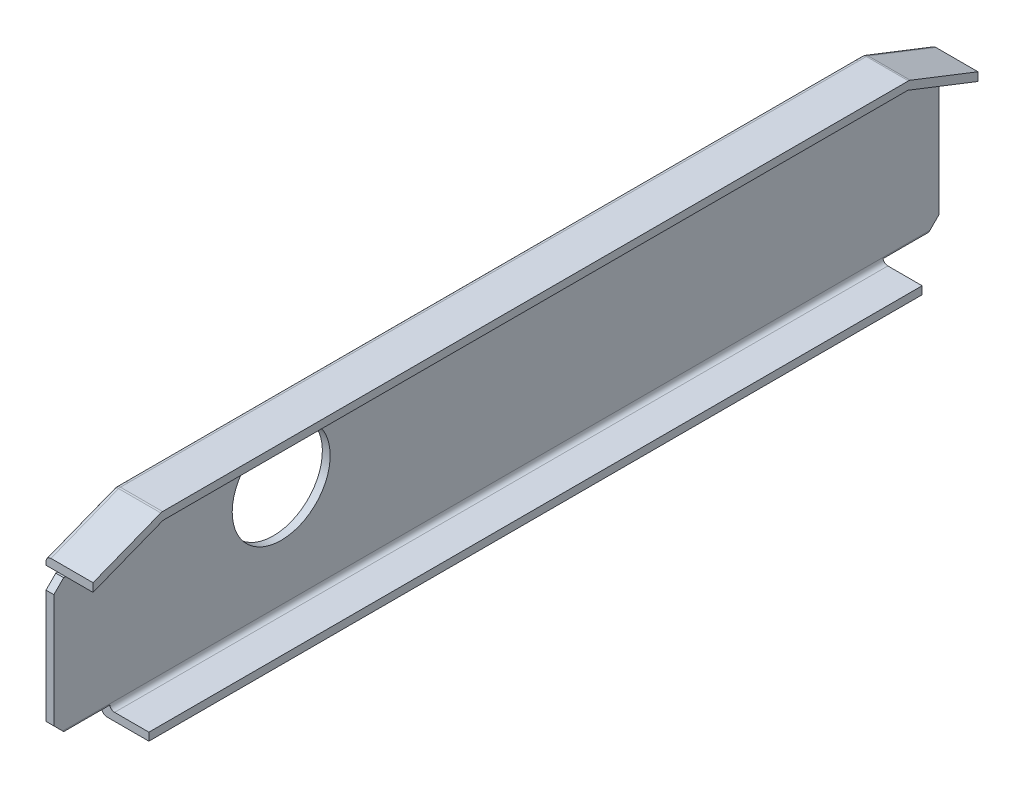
ISO-10303-21;
HEADER;
FILE_DESCRIPTION(('STEP AP214'),'2;1');
FILE_NAME('part.step','',(''),(''),'','','');
FILE_SCHEMA(('AUTOMOTIVE_DESIGN { 1 0 10303 214 1 1 1 1 }'));
ENDSEC;
DATA;
#1=APPLICATION_CONTEXT('core data for automotive mechanical design processes');
#2=APPLICATION_PROTOCOL_DEFINITION('international standard','automotive_design',2000,#1);
#3=PRODUCT_CONTEXT('',#1,'mechanical');
#4=PRODUCT('Part','Part','',(#3));
#5=PRODUCT_RELATED_PRODUCT_CATEGORY('part','',(#4));
#6=PRODUCT_DEFINITION_FORMATION('','',#4);
#7=PRODUCT_DEFINITION_CONTEXT('part definition',#1,'design');
#8=PRODUCT_DEFINITION('design','',#6,#7);
#9=PRODUCT_DEFINITION_SHAPE('','',#8);
#10=(LENGTH_UNIT() NAMED_UNIT(*) SI_UNIT(.MILLI.,.METRE.));
#11=(NAMED_UNIT(*) PLANE_ANGLE_UNIT() SI_UNIT($,.RADIAN.));
#12=(NAMED_UNIT(*) SI_UNIT($,.STERADIAN.) SOLID_ANGLE_UNIT());
#13=UNCERTAINTY_MEASURE_WITH_UNIT(LENGTH_MEASURE(1.E-05),#10,'distance_accuracy_value','');
#14=(GEOMETRIC_REPRESENTATION_CONTEXT(3) GLOBAL_UNCERTAINTY_ASSIGNED_CONTEXT((#13)) GLOBAL_UNIT_ASSIGNED_CONTEXT((#10,
#11,#12)) REPRESENTATION_CONTEXT('',''));
#15=CARTESIAN_POINT('',(0.,0.,0.));
#16=DIRECTION('',(0.,0.,1.));
#17=DIRECTION('',(1.,0.,0.));
#18=AXIS2_PLACEMENT_3D('',#15,#16,#17);
#19=CARTESIAN_POINT('',(0.,0.,903.));
#20=DIRECTION('',(1.,0.,0.));
#21=DIRECTION('',(0.,1.,0.));
#22=AXIS2_PLACEMENT_3D('',#19,#20,#21);
#23=PLANE('',#22);
#24=CARTESIAN_POINT('',(0.,-76.,671.));
#25=DIRECTION('',(-1.,0.,0.));
#26=DIRECTION('',(0.,-1.,0.));
#27=AXIS2_PLACEMENT_3D('',#24,#25,#26);
#28=CIRCLE('',#27,50.);
#29=CARTESIAN_POINT('',(0.,-126.,671.));
#30=VERTEX_POINT('',#29);
#31=EDGE_CURVE('E408',#30,#30,#28,.T.);
#32=ORIENTED_EDGE('',*,*,#31,.F.);
#33=EDGE_LOOP('',(#32));
#34=FACE_BOUND('',#33,.T.);
#35=DIRECTION('',(0.,0.,-1.));
#36=VECTOR('',#35,1.);
#37=CARTESIAN_POINT('',(0.,-5.,903.));
#38=LINE('',#37,#36);
#39=CARTESIAN_POINT('',(0.,-4.99999999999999,79.1722059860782));
#40=VERTEX_POINT('',#39);
#41=CARTESIAN_POINT('',(0.,-5.,70.9439872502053));
#42=VERTEX_POINT('',#41);
#43=EDGE_CURVE('E543',#40,#42,#38,.T.);
#44=ORIENTED_EDGE('',*,*,#43,.T.);
#45=DIRECTION('',(0.,-0.364598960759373,-0.931164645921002));
#46=VECTOR('',#45,1.);
#47=CARTESIAN_POINT('',(0.,-32.0644317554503,1.82299480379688));
#48=LINE('',#47,#46);
#49=CARTESIAN_POINT('',(0.,-32.778228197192,0.));
#50=VERTEX_POINT('',#49);
#51=EDGE_CURVE('E563',#42,#50,#48,.T.);
#52=ORIENTED_EDGE('',*,*,#51,.T.);
#53=DIRECTION('',(0.,-1.,0.));
#54=VECTOR('',#53,1.);
#55=CARTESIAN_POINT('',(0.,0.,0.));
#56=LINE('',#55,#54);
#57=CARTESIAN_POINT('',(0.,-36.,0.));
#58=VERTEX_POINT('',#57);
#59=EDGE_CURVE('E418',#50,#58,#56,.T.);
#60=ORIENTED_EDGE('',*,*,#59,.T.);
#61=DIRECTION('',(0.,0.,-1.));
#62=VECTOR('',#61,1.);
#63=CARTESIAN_POINT('',(0.,-36.,0.));
#64=LINE('',#63,#62);
#65=CARTESIAN_POINT('',(0.,-36.,57.));
#66=VERTEX_POINT('',#65);
#67=EDGE_CURVE('E378',#66,#58,#64,.T.);
#68=ORIENTED_EDGE('',*,*,#67,.F.);
#69=DIRECTION('',(0.,1.,0.));
#70=VECTOR('',#69,1.);
#71=CARTESIAN_POINT('',(0.,-36.,57.));
#72=LINE('',#71,#70);
#73=CARTESIAN_POINT('',(0.,-48.,57.));
#74=VERTEX_POINT('',#73);
#75=EDGE_CURVE('E375',#74,#66,#72,.T.);
#76=ORIENTED_EDGE('',*,*,#75,.F.);
#77=DIRECTION('',(0.,0.,1.));
#78=VECTOR('',#77,1.);
#79=CARTESIAN_POINT('',(0.,-48.,0.));
#80=LINE('',#79,#78);
#81=CARTESIAN_POINT('',(0.,-48.,10.0000000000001));
#82=VERTEX_POINT('',#81);
#83=EDGE_CURVE('E373',#82,#74,#80,.T.);
#84=ORIENTED_EDGE('',*,*,#83,.F.);
#85=DIRECTION('',(0.,0.707106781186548,0.707106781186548));
#86=VECTOR('',#85,1.);
#87=CARTESIAN_POINT('',(0.,-58.0000000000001,0.));
#88=LINE('',#87,#86);
#89=CARTESIAN_POINT('',(0.,-58.0000000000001,0.));
#90=VERTEX_POINT('',#89);
#91=EDGE_CURVE('E480',#82,#90,#88,.F.);
#92=ORIENTED_EDGE('',*,*,#91,.T.);
#93=CARTESIAN_POINT('',(0.,-174.,0.));
#94=VERTEX_POINT('',#93);
#95=EDGE_CURVE('E421',#90,#94,#56,.T.);
#96=ORIENTED_EDGE('',*,*,#95,.T.);
#97=DIRECTION('',(0.,0.707106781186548,-0.707106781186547));
#98=VECTOR('',#97,1.);
#99=CARTESIAN_POINT('',(0.,-174.,0.));
#100=LINE('',#99,#98);
#101=CARTESIAN_POINT('',(0.,-184.,10.0000000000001));
#102=VERTEX_POINT('',#101);
#103=EDGE_CURVE('E501',#94,#102,#100,.F.);
#104=ORIENTED_EDGE('',*,*,#103,.T.);
#105=DIRECTION('',(0.,0.,-1.));
#106=VECTOR('',#105,1.);
#107=CARTESIAN_POINT('',(0.,-184.,-33.0085939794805));
#108=LINE('',#107,#106);
#109=CARTESIAN_POINT('',(0.,-184.,57.));
#110=VERTEX_POINT('',#109);
#111=EDGE_CURVE('E340',#110,#102,#108,.T.);
#112=ORIENTED_EDGE('',*,*,#111,.F.);
#113=DIRECTION('',(0.,1.,0.));
#114=VECTOR('',#113,1.);
#115=CARTESIAN_POINT('',(0.,-184.,57.));
#116=LINE('',#115,#114);
#117=CARTESIAN_POINT('',(0.,-191.,57.));
#118=VERTEX_POINT('',#117);
#119=EDGE_CURVE('E334',#118,#110,#116,.T.);
#120=ORIENTED_EDGE('',*,*,#119,.F.);
#121=DIRECTION('',(0.,0.,-1.));
#122=VECTOR('',#121,1.);
#123=CARTESIAN_POINT('',(0.,-191.,903.));
#124=LINE('',#123,#122);
#125=CARTESIAN_POINT('',(0.,-191.,846.));
#126=VERTEX_POINT('',#125);
#127=EDGE_CURVE('E442',#118,#126,#124,.F.);
#128=ORIENTED_EDGE('',*,*,#127,.T.);
#129=DIRECTION('',(0.,-1.,0.));
#130=VECTOR('',#129,1.);
#131=CARTESIAN_POINT('',(0.,-184.,846.));
#132=LINE('',#131,#130);
#133=CARTESIAN_POINT('',(0.,-184.,846.));
#134=VERTEX_POINT('',#133);
#135=EDGE_CURVE('E359',#134,#126,#132,.T.);
#136=ORIENTED_EDGE('',*,*,#135,.F.);
#137=DIRECTION('',(0.,0.,-1.));
#138=VECTOR('',#137,1.);
#139=CARTESIAN_POINT('',(0.,-184.,1113.36549483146));
#140=LINE('',#139,#138);
#141=CARTESIAN_POINT('',(0.,-184.,893.));
#142=VERTEX_POINT('',#141);
#143=EDGE_CURVE('E354',#142,#134,#140,.T.);
#144=ORIENTED_EDGE('',*,*,#143,.F.);
#145=DIRECTION('',(0.,0.707106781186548,0.707106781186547));
#146=VECTOR('',#145,1.);
#147=CARTESIAN_POINT('',(0.,-184.,893.));
#148=LINE('',#147,#146);
#149=CARTESIAN_POINT('',(0.,-174.,903.));
#150=VERTEX_POINT('',#149);
#151=EDGE_CURVE('E503',#142,#150,#148,.T.);
#152=ORIENTED_EDGE('',*,*,#151,.T.);
#153=DIRECTION('',(0.,-1.,0.));
#154=VECTOR('',#153,1.);
#155=CARTESIAN_POINT('',(0.,0.,903.));
#156=LINE('',#155,#154);
#157=CARTESIAN_POINT('',(0.,-57.9999999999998,903.));
#158=VERTEX_POINT('',#157);
#159=EDGE_CURVE('E415',#158,#150,#156,.T.);
#160=ORIENTED_EDGE('',*,*,#159,.F.);
#161=DIRECTION('',(0.,0.707106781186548,-0.707106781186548));
#162=VECTOR('',#161,1.);
#163=CARTESIAN_POINT('',(0.,-48.,893.));
#164=LINE('',#163,#162);
#165=CARTESIAN_POINT('',(0.,-48.,893.));
#166=VERTEX_POINT('',#165);
#167=EDGE_CURVE('E478',#158,#166,#164,.T.);
#168=ORIENTED_EDGE('',*,*,#167,.T.);
#169=DIRECTION('',(0.,0.,1.));
#170=VECTOR('',#169,1.);
#171=CARTESIAN_POINT('',(0.,-48.,903.));
#172=LINE('',#171,#170);
#173=CARTESIAN_POINT('',(0.,-48.,846.));
#174=VERTEX_POINT('',#173);
#175=EDGE_CURVE('E396',#174,#166,#172,.T.);
#176=ORIENTED_EDGE('',*,*,#175,.F.);
#177=DIRECTION('',(0.,-1.,0.));
#178=VECTOR('',#177,1.);
#179=CARTESIAN_POINT('',(0.,-36.,846.));
#180=LINE('',#179,#178);
#181=CARTESIAN_POINT('',(0.,-36.,846.));
#182=VERTEX_POINT('',#181);
#183=EDGE_CURVE('E393',#182,#174,#180,.T.);
#184=ORIENTED_EDGE('',*,*,#183,.F.);
#185=DIRECTION('',(0.,0.,-1.));
#186=VECTOR('',#185,1.);
#187=CARTESIAN_POINT('',(0.,-36.,903.));
#188=LINE('',#187,#186);
#189=CARTESIAN_POINT('',(0.,-36.,903.));
#190=VERTEX_POINT('',#189);
#191=EDGE_CURVE('E390',#190,#182,#188,.T.);
#192=ORIENTED_EDGE('',*,*,#191,.F.);
#193=CARTESIAN_POINT('',(0.,-32.778228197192,903.));
#194=VERTEX_POINT('',#193);
#195=EDGE_CURVE('E412',#194,#190,#156,.T.);
#196=ORIENTED_EDGE('',*,*,#195,.F.);
#197=DIRECTION('',(0.,0.364598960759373,-0.931164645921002));
#198=VECTOR('',#197,1.);
#199=CARTESIAN_POINT('',(0.,-9.65582322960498,843.946715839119));
#200=LINE('',#199,#198);
#201=CARTESIAN_POINT('',(0.,-5.,832.056012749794));
#202=VERTEX_POINT('',#201);
#203=EDGE_CURVE('E528',#194,#202,#200,.T.);
#204=ORIENTED_EDGE('',*,*,#203,.T.);
#205=DIRECTION('',(0.,0.,-1.));
#206=VECTOR('',#205,1.);
#207=CARTESIAN_POINT('',(0.,-5.,903.));
#208=LINE('',#207,#206);
#209=CARTESIAN_POINT('',(0.,-4.99999999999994,823.827794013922));
#210=VERTEX_POINT('',#209);
#211=EDGE_CURVE('E520',#202,#210,#208,.T.);
#212=ORIENTED_EDGE('',*,*,#211,.T.);
#213=DIRECTION('',(0.,0.,-1.));
#214=VECTOR('',#213,1.);
#215=CARTESIAN_POINT('',(0.,-5.,903.));
#216=LINE('',#215,#214);
#217=EDGE_CURVE('E439',#210,#40,#216,.T.);
#218=ORIENTED_EDGE('',*,*,#217,.T.);
#219=EDGE_LOOP('',(#44,#52,#60,#68,#76,#84,#92,#96,#104,#112,#120,#128,#136,#144,#152,#160,#168,
#176,#184,#192,#196,#204,#212,#218));
#220=FACE_BOUND('',#219,.T.);
#221=ADVANCED_FACE('F41',(#34,#220),#23,.F.);
#222=CARTESIAN_POINT('',(8.00000000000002,-8.,903.));
#223=DIRECTION('',(0.,1.,0.));
#224=DIRECTION('',(-1.,0.,0.));
#225=AXIS2_PLACEMENT_3D('',#222,#223,#224);
#226=PLANE('',#225);
#227=DIRECTION('',(0.,0.,-1.));
#228=VECTOR('',#227,1.);
#229=CARTESIAN_POINT('',(13.,-8.,0.));
#230=LINE('',#229,#228);
#231=CARTESIAN_POINT('',(13.,-8.,830.545633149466));
#232=VERTEX_POINT('',#231);
#233=CARTESIAN_POINT('',(13.,-8.,72.4543668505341));
#234=VERTEX_POINT('',#233);
#235=EDGE_CURVE('E451',#232,#234,#230,.T.);
#236=ORIENTED_EDGE('',*,*,#235,.T.);
#237=DIRECTION('',(1.,0.,0.));
#238=VECTOR('',#237,1.);
#239=CARTESIAN_POINT('',(8.00000000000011,-8.,72.4543668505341));
#240=LINE('',#239,#238);
#241=CARTESIAN_POINT('',(48.,-8.,72.4543668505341));
#242=VERTEX_POINT('',#241);
#243=EDGE_CURVE('E583',#234,#242,#240,.T.);
#244=ORIENTED_EDGE('',*,*,#243,.T.);
#245=DIRECTION('',(0.,0.,-1.));
#246=VECTOR('',#245,1.);
#247=CARTESIAN_POINT('',(48.,-8.,903.));
#248=LINE('',#247,#246);
#249=CARTESIAN_POINT('',(48.,-8.,830.545633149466));
#250=VERTEX_POINT('',#249);
#251=EDGE_CURVE('E431',#250,#242,#248,.T.);
#252=ORIENTED_EDGE('',*,*,#251,.F.);
#253=DIRECTION('',(-1.,0.,0.));
#254=VECTOR('',#253,1.);
#255=CARTESIAN_POINT('',(8.00000000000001,-8.,830.545633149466));
#256=LINE('',#255,#254);
#257=EDGE_CURVE('E553',#250,#232,#256,.T.);
#258=ORIENTED_EDGE('',*,*,#257,.T.);
#259=EDGE_LOOP('',(#236,#244,#252,#258));
#260=FACE_BOUND('',#259,.T.);
#261=ADVANCED_FACE('F688',(#260),#226,.F.);
#262=CARTESIAN_POINT('',(8.00000000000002,-188.,903.));
#263=DIRECTION('',(-1.,0.,0.));
#264=DIRECTION('',(0.,0.,1.));
#265=AXIS2_PLACEMENT_3D('',#262,#263,#264);
#266=PLANE('',#265);
#267=CARTESIAN_POINT('',(8.00000000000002,-76.,671.));
#268=DIRECTION('',(-1.,0.,0.));
#269=DIRECTION('',(0.,0.,1.));
#270=AXIS2_PLACEMENT_3D('',#267,#268,#269);
#271=CIRCLE('',#270,50.);
#272=CARTESIAN_POINT('',(8.00000000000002,-76.,721.));
#273=VERTEX_POINT('',#272);
#274=EDGE_CURVE('E411',#273,#273,#271,.T.);
#275=ORIENTED_EDGE('',*,*,#274,.T.);
#276=EDGE_LOOP('',(#275));
#277=FACE_BOUND('',#276,.T.);
#278=DIRECTION('',(0.,0.,-1.));
#279=VECTOR('',#278,1.);
#280=CARTESIAN_POINT('',(8.00000000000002,-36.,903.));
#281=LINE('',#280,#279);
#282=CARTESIAN_POINT('',(8.00000000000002,-36.,57.));
#283=VERTEX_POINT('',#282);
#284=CARTESIAN_POINT('',(8.00000000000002,-36.,13.7136978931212));
#285=VERTEX_POINT('',#284);
#286=EDGE_CURVE('E388',#283,#285,#281,.T.);
#287=ORIENTED_EDGE('',*,*,#286,.T.);
#288=DIRECTION('',(0.,0.364598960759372,0.931164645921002));
#289=VECTOR('',#288,1.);
#290=CARTESIAN_POINT('',(8.00000000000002,245.708452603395,733.180782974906));
#291=LINE('',#290,#289);
#292=CARTESIAN_POINT('',(8.00000000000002,-13.,72.4543668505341));
#293=VERTEX_POINT('',#292);
#294=EDGE_CURVE('E600',#285,#293,#291,.T.);
#295=ORIENTED_EDGE('',*,*,#294,.T.);
#296=DIRECTION('',(0.,0.,-1.));
#297=VECTOR('',#296,1.);
#298=CARTESIAN_POINT('',(8.00000000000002,-13.,903.));
#299=LINE('',#298,#297);
#300=CARTESIAN_POINT('',(8.00000000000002,-13.,830.545633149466));
#301=VERTEX_POINT('',#300);
#302=EDGE_CURVE('E444',#293,#301,#299,.F.);
#303=ORIENTED_EDGE('',*,*,#302,.T.);
#304=DIRECTION('',(0.,-0.364598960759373,0.931164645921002));
#305=VECTOR('',#304,1.);
#306=CARTESIAN_POINT('',(8.00000000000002,-60.8615483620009,952.781257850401));
#307=LINE('',#306,#305);
#308=CARTESIAN_POINT('',(8.00000000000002,-36.,889.286302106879));
#309=VERTEX_POINT('',#308);
#310=EDGE_CURVE('E572',#301,#309,#307,.T.);
#311=ORIENTED_EDGE('',*,*,#310,.T.);
#312=DIRECTION('',(0.,0.,-1.));
#313=VECTOR('',#312,1.);
#314=CARTESIAN_POINT('',(8.00000000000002,-36.,903.));
#315=LINE('',#314,#313);
#316=CARTESIAN_POINT('',(8.00000000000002,-36.,846.));
#317=VERTEX_POINT('',#316);
#318=EDGE_CURVE('E402',#309,#317,#315,.T.);
#319=ORIENTED_EDGE('',*,*,#318,.T.);
#320=DIRECTION('',(0.,-1.,0.));
#321=VECTOR('',#320,1.);
#322=CARTESIAN_POINT('',(8.00000000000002,-188.,846.));
#323=LINE('',#322,#321);
#324=CARTESIAN_POINT('',(8.00000000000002,-48.,846.));
#325=VERTEX_POINT('',#324);
#326=EDGE_CURVE('E459',#317,#325,#323,.T.);
#327=ORIENTED_EDGE('',*,*,#326,.T.);
#328=DIRECTION('',(0.,0.,1.));
#329=VECTOR('',#328,1.);
#330=CARTESIAN_POINT('',(8.00000000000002,-48.,903.));
#331=LINE('',#330,#329);
#332=CARTESIAN_POINT('',(8.00000000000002,-48.,893.));
#333=VERTEX_POINT('',#332);
#334=EDGE_CURVE('E405',#325,#333,#331,.T.);
#335=ORIENTED_EDGE('',*,*,#334,.T.);
#336=DIRECTION('',(0.,-0.707106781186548,0.707106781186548));
#337=VECTOR('',#336,1.);
#338=CARTESIAN_POINT('',(8.00000000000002,-48.,893.));
#339=LINE('',#338,#337);
#340=CARTESIAN_POINT('',(8.00000000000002,-57.9999999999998,903.));
#341=VERTEX_POINT('',#340);
#342=EDGE_CURVE('E471',#333,#341,#339,.T.);
#343=ORIENTED_EDGE('',*,*,#342,.T.);
#344=DIRECTION('',(0.,1.,0.));
#345=VECTOR('',#344,1.);
#346=CARTESIAN_POINT('',(8.00000000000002,-188.,903.));
#347=LINE('',#346,#345);
#348=CARTESIAN_POINT('',(8.00000000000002,-174.,903.));
#349=VERTEX_POINT('',#348);
#350=EDGE_CURVE('E414',#349,#341,#347,.T.);
#351=ORIENTED_EDGE('',*,*,#350,.F.);
#352=DIRECTION('',(0.,-0.707106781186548,-0.707106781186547));
#353=VECTOR('',#352,1.);
#354=CARTESIAN_POINT('',(8.00000000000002,-184.,893.));
#355=LINE('',#354,#353);
#356=CARTESIAN_POINT('',(8.00000000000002,-183.,894.));
#357=VERTEX_POINT('',#356);
#358=EDGE_CURVE('E509',#349,#357,#355,.T.);
#359=ORIENTED_EDGE('',*,*,#358,.T.);
#360=DIRECTION('',(0.,0.,-1.));
#361=VECTOR('',#360,1.);
#362=CARTESIAN_POINT('',(8.00000000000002,-183.,0.));
#363=LINE('',#362,#361);
#364=CARTESIAN_POINT('',(8.00000000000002,-183.,9.00000000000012));
#365=VERTEX_POINT('',#364);
#366=EDGE_CURVE('E446',#357,#365,#363,.T.);
#367=ORIENTED_EDGE('',*,*,#366,.T.);
#368=DIRECTION('',(0.,-0.707106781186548,0.707106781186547));
#369=VECTOR('',#368,1.);
#370=CARTESIAN_POINT('',(8.00000000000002,-174.,0.));
#371=LINE('',#370,#369);
#372=CARTESIAN_POINT('',(8.00000000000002,-174.,0.));
#373=VERTEX_POINT('',#372);
#374=EDGE_CURVE('E507',#365,#373,#371,.F.);
#375=ORIENTED_EDGE('',*,*,#374,.T.);
#376=DIRECTION('',(0.,1.,0.));
#377=VECTOR('',#376,1.);
#378=CARTESIAN_POINT('',(8.00000000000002,-188.,0.));
#379=LINE('',#378,#377);
#380=CARTESIAN_POINT('',(8.00000000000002,-58.0000000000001,0.));
#381=VERTEX_POINT('',#380);
#382=EDGE_CURVE('E420',#373,#381,#379,.T.);
#383=ORIENTED_EDGE('',*,*,#382,.T.);
#384=DIRECTION('',(0.,-0.707106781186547,-0.707106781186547));
#385=VECTOR('',#384,1.);
#386=CARTESIAN_POINT('',(8.00000000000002,-58.0000000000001,0.));
#387=LINE('',#386,#385);
#388=CARTESIAN_POINT('',(8.00000000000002,-48.,10.0000000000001));
#389=VERTEX_POINT('',#388);
#390=EDGE_CURVE('E474',#381,#389,#387,.F.);
#391=ORIENTED_EDGE('',*,*,#390,.T.);
#392=DIRECTION('',(0.,0.,1.));
#393=VECTOR('',#392,1.);
#394=CARTESIAN_POINT('',(8.00000000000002,-48.,903.));
#395=LINE('',#394,#393);
#396=CARTESIAN_POINT('',(8.00000000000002,-48.,57.));
#397=VERTEX_POINT('',#396);
#398=EDGE_CURVE('E384',#389,#397,#395,.T.);
#399=ORIENTED_EDGE('',*,*,#398,.T.);
#400=DIRECTION('',(0.,1.,0.));
#401=VECTOR('',#400,1.);
#402=CARTESIAN_POINT('',(8.00000000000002,-188.,57.));
#403=LINE('',#402,#401);
#404=EDGE_CURVE('E465',#397,#283,#403,.T.);
#405=ORIENTED_EDGE('',*,*,#404,.T.);
#406=EDGE_LOOP('',(#287,#295,#303,#311,#319,#327,#335,#343,#351,#359,#367,#375,#383,#391,#399,#405));
#407=FACE_BOUND('',#406,.T.);
#408=ADVANCED_FACE('F694',(#277,#407),#266,.F.);
#409=CARTESIAN_POINT('',(13.,-13.,903.));
#410=DIRECTION('',(0.,0.,1.));
#411=DIRECTION('',(1.,0.,0.));
#412=AXIS2_PLACEMENT_3D('',#409,#410,#411);
#413=CYLINDRICAL_SURFACE('',#412,5.);
#414=ORIENTED_EDGE('',*,*,#302,.F.);
#415=CARTESIAN_POINT('',(13.,-13.,72.4543668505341));
#416=DIRECTION('',(0.,0.,1.));
#417=DIRECTION('',(1.,0.,0.));
#418=AXIS2_PLACEMENT_3D('',#415,#416,#417);
#419=CIRCLE('',#418,5.);
#420=EDGE_CURVE('E598',#293,#234,#419,.F.);
#421=ORIENTED_EDGE('',*,*,#420,.T.);
#422=ORIENTED_EDGE('',*,*,#235,.F.);
#423=CARTESIAN_POINT('',(13.,-13.,830.545633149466));
#424=DIRECTION('',(0.,0.,1.));
#425=DIRECTION('',(1.,0.,0.));
#426=AXIS2_PLACEMENT_3D('',#423,#424,#425);
#427=CIRCLE('',#426,5.);
#428=EDGE_CURVE('E560',#232,#301,#427,.T.);
#429=ORIENTED_EDGE('',*,*,#428,.T.);
#430=EDGE_LOOP('',(#414,#421,#422,#429));
#431=FACE_BOUND('',#430,.T.);
#432=ADVANCED_FACE('F691',(#431),#413,.F.);
#433=CARTESIAN_POINT('',(5.,-5.,903.));
#434=DIRECTION('',(0.,0.,-1.));
#435=DIRECTION('',(-1.,0.,0.));
#436=AXIS2_PLACEMENT_3D('',#433,#434,#435);
#437=CYLINDRICAL_SURFACE('',#436,5.);
#438=DIRECTION('',(0.,0.,-1.));
#439=VECTOR('',#438,1.);
#440=CARTESIAN_POINT('',(5.,0.,903.));
#441=LINE('',#440,#439);
#442=CARTESIAN_POINT('',(5.,0.,79.1722059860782));
#443=VERTEX_POINT('',#442);
#444=CARTESIAN_POINT('',(5.,0.,823.827794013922));
#445=VERTEX_POINT('',#444);
#446=EDGE_CURVE('E454',#443,#445,#441,.F.);
#447=ORIENTED_EDGE('',*,*,#446,.F.);
#448=CARTESIAN_POINT('',(5.,-4.99999999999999,79.1722059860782));
#449=DIRECTION('',(0.,0.,-1.));
#450=DIRECTION('',(-1.,0.,0.));
#451=AXIS2_PLACEMENT_3D('',#448,#449,#450);
#452=CIRCLE('',#451,5.);
#453=EDGE_CURVE('E551',#443,#40,#452,.F.);
#454=ORIENTED_EDGE('',*,*,#453,.T.);
#455=ORIENTED_EDGE('',*,*,#217,.F.);
#456=CARTESIAN_POINT('',(5.,-5.,823.827794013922));
#457=DIRECTION('',(0.,0.,-1.));
#458=DIRECTION('',(-1.,0.,0.));
#459=AXIS2_PLACEMENT_3D('',#456,#457,#458);
#460=CIRCLE('',#459,5.);
#461=EDGE_CURVE('E525',#210,#445,#460,.T.);
#462=ORIENTED_EDGE('',*,*,#461,.T.);
#463=EDGE_LOOP('',(#447,#454,#455,#462));
#464=FACE_BOUND('',#463,.T.);
#465=ADVANCED_FACE('F644',(#464),#437,.T.);
#466=CARTESIAN_POINT('',(8.00000000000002,-8.00000000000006,0.));
#467=DIRECTION('',(0.,0.,1.));
#468=DIRECTION('',(1.,0.,0.));
#469=AXIS2_PLACEMENT_3D('',#466,#467,#468);
#470=PLANE('',#469);
#471=ORIENTED_EDGE('',*,*,#59,.F.);
#472=CARTESIAN_POINT('',(5.,-32.778228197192,0.));
#473=DIRECTION('',(0.,0.,1.));
#474=DIRECTION('',(0.,1.,0.));
#475=AXIS2_PLACEMENT_3D('',#472,#473,#474);
#476=ELLIPSE('',#475,5.3696196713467,5.);
#477=CARTESIAN_POINT('',(5.,-27.4086085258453,0.));
#478=VERTEX_POINT('',#477);
#479=EDGE_CURVE('E295',#50,#478,#476,.F.);
#480=ORIENTED_EDGE('',*,*,#479,.T.);
#481=DIRECTION('',(1.,0.,0.));
#482=VECTOR('',#481,1.);
#483=CARTESIAN_POINT('',(-98.738624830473,-27.4086085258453,0.));
#484=LINE('',#483,#482);
#485=CARTESIAN_POINT('',(48.,-27.4086085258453,0.));
#486=VERTEX_POINT('',#485);
#487=EDGE_CURVE('E288',#478,#486,#484,.T.);
#488=ORIENTED_EDGE('',*,*,#487,.T.);
#489=DIRECTION('',(0.,1.,0.));
#490=VECTOR('',#489,1.);
#491=CARTESIAN_POINT('',(48.,-27.4086085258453,0.));
#492=LINE('',#491,#490);
#493=CARTESIAN_POINT('',(48.,-36.,0.));
#494=VERTEX_POINT('',#493);
#495=EDGE_CURVE('E294',#494,#486,#492,.T.);
#496=ORIENTED_EDGE('',*,*,#495,.F.);
#497=DIRECTION('',(1.,0.,0.));
#498=VECTOR('',#497,1.);
#499=CARTESIAN_POINT('',(-98.738624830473,-36.,0.));
#500=LINE('',#499,#498);
#501=CARTESIAN_POINT('',(13.,-36.,0.));
#502=VERTEX_POINT('',#501);
#503=EDGE_CURVE('E298',#502,#494,#500,.T.);
#504=ORIENTED_EDGE('',*,*,#503,.F.);
#505=DIRECTION('',(-1.,0.,0.));
#506=VECTOR('',#505,1.);
#507=CARTESIAN_POINT('',(8.00000000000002,-36.,0.));
#508=LINE('',#507,#506);
#509=EDGE_CURVE('E462',#502,#58,#508,.T.);
#510=ORIENTED_EDGE('',*,*,#509,.T.);
#511=EDGE_LOOP('',(#471,#480,#488,#496,#504,#510));
#512=FACE_BOUND('',#511,.T.);
#513=ADVANCED_FACE('F291',(#512),#470,.F.);
#514=CARTESIAN_POINT('',(8.00000000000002,-8.00000000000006,903.));
#515=DIRECTION('',(0.,0.,1.));
#516=DIRECTION('',(1.,0.,0.));
#517=AXIS2_PLACEMENT_3D('',#514,#515,#516);
#518=PLANE('',#517);
#519=ORIENTED_EDGE('',*,*,#159,.T.);
#520=DIRECTION('',(1.,0.,0.));
#521=VECTOR('',#520,1.);
#522=CARTESIAN_POINT('',(8.10102051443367,-174.,903.));
#523=LINE('',#522,#521);
#524=EDGE_CURVE('E505',#150,#349,#523,.T.);
#525=ORIENTED_EDGE('',*,*,#524,.T.);
#526=ORIENTED_EDGE('',*,*,#350,.T.);
#527=DIRECTION('',(-1.,0.,0.));
#528=VECTOR('',#527,1.);
#529=CARTESIAN_POINT('',(0.,-57.9999999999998,903.));
#530=LINE('',#529,#528);
#531=EDGE_CURVE('E485',#341,#158,#530,.T.);
#532=ORIENTED_EDGE('',*,*,#531,.T.);
#533=EDGE_LOOP('',(#519,#525,#526,#532));
#534=FACE_BOUND('',#533,.T.);
#535=ADVANCED_FACE('F766',(#534),#518,.T.);
#536=CARTESIAN_POINT('',(48.,-8.,903.));
#537=DIRECTION('',(-1.,0.,0.));
#538=DIRECTION('',(0.,0.,1.));
#539=AXIS2_PLACEMENT_3D('',#536,#537,#538);
#540=PLANE('',#539);
#541=DIRECTION('',(0.,0.364598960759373,0.931164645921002));
#542=VECTOR('',#541,1.);
#543=CARTESIAN_POINT('',(48.,0.,70.));
#544=LINE('',#543,#542);
#545=CARTESIAN_POINT('',(48.,-0.344176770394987,69.1209924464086));
#546=VERTEX_POINT('',#545);
#547=EDGE_CURVE('E302',#486,#546,#544,.T.);
#548=ORIENTED_EDGE('',*,*,#547,.T.);
#549=CARTESIAN_POINT('',(48.,-5.,70.9439872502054));
#550=DIRECTION('',(-1.,0.,0.));
#551=DIRECTION('',(0.,0.,1.));
#552=AXIS2_PLACEMENT_3D('',#549,#550,#551);
#553=CIRCLE('',#552,5.);
#554=CARTESIAN_POINT('',(48.,0.,70.9439872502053));
#555=VERTEX_POINT('',#554);
#556=EDGE_CURVE('E574',#546,#555,#553,.F.);
#557=ORIENTED_EDGE('',*,*,#556,.T.);
#558=DIRECTION('',(0.,0.,-1.));
#559=VECTOR('',#558,1.);
#560=CARTESIAN_POINT('',(48.,0.,903.));
#561=LINE('',#560,#559);
#562=CARTESIAN_POINT('',(48.,0.,832.056012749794));
#563=VERTEX_POINT('',#562);
#564=EDGE_CURVE('E428',#563,#555,#561,.T.);
#565=ORIENTED_EDGE('',*,*,#564,.F.);
#566=CARTESIAN_POINT('',(48.,-5.,832.056012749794));
#567=DIRECTION('',(-1.,0.,0.));
#568=DIRECTION('',(0.,0.,1.));
#569=AXIS2_PLACEMENT_3D('',#566,#567,#568);
#570=CIRCLE('',#569,5.);
#571=CARTESIAN_POINT('',(48.,-0.344176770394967,833.879007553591));
#572=VERTEX_POINT('',#571);
#573=EDGE_CURVE('E541',#563,#572,#570,.F.);
#574=ORIENTED_EDGE('',*,*,#573,.T.);
#575=DIRECTION('',(0.,-0.364598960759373,0.931164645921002));
#576=VECTOR('',#575,1.);
#577=CARTESIAN_POINT('',(48.,0.,833.));
#578=LINE('',#577,#576);
#579=CARTESIAN_POINT('',(48.,-27.4086085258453,903.));
#580=VERTEX_POINT('',#579);
#581=EDGE_CURVE('E328',#572,#580,#578,.T.);
#582=ORIENTED_EDGE('',*,*,#581,.T.);
#583=DIRECTION('',(0.,-1.,0.));
#584=VECTOR('',#583,1.);
#585=CARTESIAN_POINT('',(48.,-27.4086085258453,903.));
#586=LINE('',#585,#584);
#587=CARTESIAN_POINT('',(48.,-36.0000000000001,903.));
#588=VERTEX_POINT('',#587);
#589=EDGE_CURVE('E321',#580,#588,#586,.T.);
#590=ORIENTED_EDGE('',*,*,#589,.T.);
#591=DIRECTION('',(0.,0.364598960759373,-0.931164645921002));
#592=VECTOR('',#591,1.);
#593=CARTESIAN_POINT('',(48.,-36.0000000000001,903.));
#594=LINE('',#593,#592);
#595=CARTESIAN_POINT('',(48.,-8.34417677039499,832.368627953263));
#596=VERTEX_POINT('',#595);
#597=EDGE_CURVE('E324',#588,#596,#594,.T.);
#598=ORIENTED_EDGE('',*,*,#597,.T.);
#599=CARTESIAN_POINT('',(48.,-13.,830.545633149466));
#600=DIRECTION('',(-1.,0.,0.));
#601=DIRECTION('',(0.,0.,1.));
#602=AXIS2_PLACEMENT_3D('',#599,#600,#601);
#603=CIRCLE('',#602,5.);
#604=EDGE_CURVE('E578',#596,#250,#603,.T.);
#605=ORIENTED_EDGE('',*,*,#604,.T.);
#606=ORIENTED_EDGE('',*,*,#251,.T.);
#607=CARTESIAN_POINT('',(48.,-13.,72.4543668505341));
#608=DIRECTION('',(-1.,0.,0.));
#609=DIRECTION('',(0.,0.,1.));
#610=AXIS2_PLACEMENT_3D('',#607,#608,#609);
#611=CIRCLE('',#610,5.);
#612=CARTESIAN_POINT('',(48.,-8.34417677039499,70.6313720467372));
#613=VERTEX_POINT('',#612);
#614=EDGE_CURVE('E51',#242,#613,#611,.T.);
#615=ORIENTED_EDGE('',*,*,#614,.T.);
#616=DIRECTION('',(0.,-0.364598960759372,-0.931164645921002));
#617=VECTOR('',#616,1.);
#618=CARTESIAN_POINT('',(48.,-36.,0.));
#619=LINE('',#618,#617);
#620=EDGE_CURVE('E299',#613,#494,#619,.T.);
#621=ORIENTED_EDGE('',*,*,#620,.T.);
#622=ORIENTED_EDGE('',*,*,#495,.T.);
#623=EDGE_LOOP('',(#548,#557,#565,#574,#582,#590,#598,#605,#606,#615,#621,#622));
#624=FACE_BOUND('',#623,.T.);
#625=ADVANCED_FACE('F309',(#624),#540,.F.);
#626=CARTESIAN_POINT('',(48.,0.,903.));
#627=DIRECTION('',(0.,-1.,0.));
#628=DIRECTION('',(1.,0.,0.));
#629=AXIS2_PLACEMENT_3D('',#626,#627,#628);
#630=PLANE('',#629);
#631=ORIENTED_EDGE('',*,*,#564,.T.);
#632=DIRECTION('',(1.,0.,0.));
#633=VECTOR('',#632,1.);
#634=CARTESIAN_POINT('',(5.,0.,70.9439872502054));
#635=LINE('',#634,#633);
#636=CARTESIAN_POINT('',(5.,0.,70.9439872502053));
#637=VERTEX_POINT('',#636);
#638=EDGE_CURVE('E576',#555,#637,#635,.F.);
#639=ORIENTED_EDGE('',*,*,#638,.T.);
#640=DIRECTION('',(0.,0.,-1.));
#641=VECTOR('',#640,1.);
#642=CARTESIAN_POINT('',(5.,0.,903.));
#643=LINE('',#642,#641);
#644=EDGE_CURVE('E549',#637,#443,#643,.F.);
#645=ORIENTED_EDGE('',*,*,#644,.T.);
#646=ORIENTED_EDGE('',*,*,#446,.T.);
#647=DIRECTION('',(0.,0.,-1.));
#648=VECTOR('',#647,1.);
#649=CARTESIAN_POINT('',(5.,0.,903.));
#650=LINE('',#649,#648);
#651=CARTESIAN_POINT('',(5.,0.,832.056012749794));
#652=VERTEX_POINT('',#651);
#653=EDGE_CURVE('E522',#445,#652,#650,.F.);
#654=ORIENTED_EDGE('',*,*,#653,.T.);
#655=DIRECTION('',(1.,0.,0.));
#656=VECTOR('',#655,1.);
#657=CARTESIAN_POINT('',(48.,0.,832.056012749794));
#658=LINE('',#657,#656);
#659=EDGE_CURVE('E539',#652,#563,#658,.T.);
#660=ORIENTED_EDGE('',*,*,#659,.T.);
#661=EDGE_LOOP('',(#631,#639,#645,#646,#654,#660));
#662=FACE_BOUND('',#661,.T.);
#663=ADVANCED_FACE('F642',(#662),#630,.F.);
#664=CARTESIAN_POINT('',(0.,-196.,903.));
#665=DIRECTION('',(0.,1.,0.));
#666=DIRECTION('',(0.,0.,1.));
#667=AXIS2_PLACEMENT_3D('',#664,#665,#666);
#668=PLANE('',#667);
#669=DIRECTION('',(0.,0.,-1.));
#670=VECTOR('',#669,1.);
#671=CARTESIAN_POINT('',(5.00000000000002,-196.,903.));
#672=LINE('',#671,#670);
#673=CARTESIAN_POINT('',(5.00000000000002,-196.,846.));
#674=VERTEX_POINT('',#673);
#675=CARTESIAN_POINT('',(5.00000000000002,-196.,57.));
#676=VERTEX_POINT('',#675);
#677=EDGE_CURVE('E434',#674,#676,#672,.T.);
#678=ORIENTED_EDGE('',*,*,#677,.T.);
#679=DIRECTION('',(1.,0.,0.));
#680=VECTOR('',#679,1.);
#681=CARTESIAN_POINT('',(0.,-196.,57.));
#682=LINE('',#681,#680);
#683=CARTESIAN_POINT('',(48.,-196.,57.));
#684=VERTEX_POINT('',#683);
#685=EDGE_CURVE('E351',#676,#684,#682,.T.);
#686=ORIENTED_EDGE('',*,*,#685,.T.);
#687=DIRECTION('',(0.,0.,-1.));
#688=VECTOR('',#687,1.);
#689=CARTESIAN_POINT('',(48.,-196.,903.));
#690=LINE('',#689,#688);
#691=CARTESIAN_POINT('',(48.,-196.,846.));
#692=VERTEX_POINT('',#691);
#693=EDGE_CURVE('E425',#692,#684,#690,.T.);
#694=ORIENTED_EDGE('',*,*,#693,.F.);
#695=DIRECTION('',(-1.,0.,0.));
#696=VECTOR('',#695,1.);
#697=CARTESIAN_POINT('',(0.,-196.,846.));
#698=LINE('',#697,#696);
#699=EDGE_CURVE('E370',#692,#674,#698,.T.);
#700=ORIENTED_EDGE('',*,*,#699,.T.);
#701=EDGE_LOOP('',(#678,#686,#694,#700));
#702=FACE_BOUND('',#701,.T.);
#703=ADVANCED_FACE('F755',(#702),#668,.F.);
#704=CARTESIAN_POINT('',(48.,-196.,903.));
#705=DIRECTION('',(-1.,0.,0.));
#706=DIRECTION('',(0.,0.,1.));
#707=AXIS2_PLACEMENT_3D('',#704,#705,#706);
#708=PLANE('',#707);
#709=ORIENTED_EDGE('',*,*,#693,.T.);
#710=DIRECTION('',(0.,1.,0.));
#711=VECTOR('',#710,1.);
#712=CARTESIAN_POINT('',(48.,-184.,57.));
#713=LINE('',#712,#711);
#714=CARTESIAN_POINT('',(48.,-188.,57.));
#715=VERTEX_POINT('',#714);
#716=EDGE_CURVE('E336',#684,#715,#713,.T.);
#717=ORIENTED_EDGE('',*,*,#716,.T.);
#718=DIRECTION('',(0.,0.,-1.));
#719=VECTOR('',#718,1.);
#720=CARTESIAN_POINT('',(48.,-188.,903.));
#721=LINE('',#720,#719);
#722=CARTESIAN_POINT('',(48.,-188.,846.));
#723=VERTEX_POINT('',#722);
#724=EDGE_CURVE('E417',#723,#715,#721,.T.);
#725=ORIENTED_EDGE('',*,*,#724,.F.);
#726=DIRECTION('',(0.,-1.,0.));
#727=VECTOR('',#726,1.);
#728=CARTESIAN_POINT('',(48.,-184.,846.));
#729=LINE('',#728,#727);
#730=EDGE_CURVE('E355',#723,#692,#729,.T.);
#731=ORIENTED_EDGE('',*,*,#730,.T.);
#732=EDGE_LOOP('',(#709,#717,#725,#731));
#733=FACE_BOUND('',#732,.T.);
#734=ADVANCED_FACE('F752',(#733),#708,.F.);
#735=CARTESIAN_POINT('',(48.,-188.,903.));
#736=DIRECTION('',(0.,-1.,0.));
#737=DIRECTION('',(0.,0.,-1.));
#738=AXIS2_PLACEMENT_3D('',#735,#736,#737);
#739=PLANE('',#738);
#740=ORIENTED_EDGE('',*,*,#724,.T.);
#741=DIRECTION('',(-1.,0.,0.));
#742=VECTOR('',#741,1.);
#743=CARTESIAN_POINT('',(48.,-188.,57.));
#744=LINE('',#743,#742);
#745=CARTESIAN_POINT('',(13.,-188.,57.));
#746=VERTEX_POINT('',#745);
#747=EDGE_CURVE('E346',#715,#746,#744,.T.);
#748=ORIENTED_EDGE('',*,*,#747,.T.);
#749=DIRECTION('',(0.,0.,-1.));
#750=VECTOR('',#749,1.);
#751=CARTESIAN_POINT('',(13.,-188.,903.));
#752=LINE('',#751,#750);
#753=CARTESIAN_POINT('',(13.,-188.,846.));
#754=VERTEX_POINT('',#753);
#755=EDGE_CURVE('E449',#746,#754,#752,.F.);
#756=ORIENTED_EDGE('',*,*,#755,.T.);
#757=DIRECTION('',(1.,0.,0.));
#758=VECTOR('',#757,1.);
#759=CARTESIAN_POINT('',(48.,-188.,846.));
#760=LINE('',#759,#758);
#761=EDGE_CURVE('E365',#754,#723,#760,.T.);
#762=ORIENTED_EDGE('',*,*,#761,.T.);
#763=EDGE_LOOP('',(#740,#748,#756,#762));
#764=FACE_BOUND('',#763,.T.);
#765=ADVANCED_FACE('F747',(#764),#739,.F.);
#766=DIRECTION('',(1.,0.,0.));
#767=VECTOR('',#766,1.);
#768=CARTESIAN_POINT('',(-98.7386248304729,-27.4086085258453,903.));
#769=LINE('',#768,#767);
#770=CARTESIAN_POINT('',(5.,-27.4086085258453,903.));
#771=VERTEX_POINT('',#770);
#772=EDGE_CURVE('E331',#771,#580,#769,.T.);
#773=ORIENTED_EDGE('',*,*,#772,.F.);
#774=CARTESIAN_POINT('',(5.,-32.778228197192,903.));
#775=DIRECTION('',(0.,0.,1.));
#776=DIRECTION('',(0.,-1.,0.));
#777=AXIS2_PLACEMENT_3D('',#774,#775,#776);
#778=ELLIPSE('',#777,5.3696196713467,5.);
#779=EDGE_CURVE('E535',#771,#194,#778,.T.);
#780=ORIENTED_EDGE('',*,*,#779,.T.);
#781=ORIENTED_EDGE('',*,*,#195,.T.);
#782=DIRECTION('',(-1.,0.,0.));
#783=VECTOR('',#782,1.);
#784=CARTESIAN_POINT('',(8.00000000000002,-36.,903.));
#785=LINE('',#784,#783);
#786=CARTESIAN_POINT('',(13.,-36.0000000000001,903.));
#787=VERTEX_POINT('',#786);
#788=EDGE_CURVE('E456',#787,#190,#785,.T.);
#789=ORIENTED_EDGE('',*,*,#788,.F.);
#790=DIRECTION('',(1.,0.,0.));
#791=VECTOR('',#790,1.);
#792=CARTESIAN_POINT('',(-98.7386248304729,-36.0000000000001,903.));
#793=LINE('',#792,#791);
#794=EDGE_CURVE('E330',#787,#588,#793,.T.);
#795=ORIENTED_EDGE('',*,*,#794,.T.);
#796=ORIENTED_EDGE('',*,*,#589,.F.);
#797=EDGE_LOOP('',(#773,#780,#781,#789,#795,#796));
#798=FACE_BOUND('',#797,.T.);
#799=ADVANCED_FACE('F673',(#798),#518,.T.);
#800=ORIENTED_EDGE('',*,*,#382,.F.);
#801=DIRECTION('',(-1.,0.,0.));
#802=VECTOR('',#801,1.);
#803=CARTESIAN_POINT('',(8.00000000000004,-174.,0.));
#804=LINE('',#803,#802);
#805=EDGE_CURVE('E515',#373,#94,#804,.T.);
#806=ORIENTED_EDGE('',*,*,#805,.T.);
#807=ORIENTED_EDGE('',*,*,#95,.F.);
#808=DIRECTION('',(1.,0.,0.));
#809=VECTOR('',#808,1.);
#810=CARTESIAN_POINT('',(8.00000000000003,-58.0000000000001,0.));
#811=LINE('',#810,#809);
#812=EDGE_CURVE('E468',#90,#381,#811,.T.);
#813=ORIENTED_EDGE('',*,*,#812,.T.);
#814=EDGE_LOOP('',(#800,#806,#807,#813));
#815=FACE_BOUND('',#814,.T.);
#816=ADVANCED_FACE('F713',(#815),#470,.F.);
#817=CARTESIAN_POINT('',(48.,-76.,671.));
#818=DIRECTION('',(-1.,0.,0.));
#819=DIRECTION('',(0.,-1.,0.));
#820=AXIS2_PLACEMENT_3D('',#817,#818,#819);
#821=CYLINDRICAL_SURFACE('',#820,50.);
#822=ORIENTED_EDGE('',*,*,#31,.T.);
#823=EDGE_LOOP('',(#822));
#824=FACE_BOUND('',#823,.T.);
#825=ORIENTED_EDGE('',*,*,#274,.F.);
#826=EDGE_LOOP('',(#825));
#827=FACE_BOUND('',#826,.T.);
#828=ADVANCED_FACE('F817',(#824,#827),#821,.F.);
#829=CARTESIAN_POINT('',(5.00000000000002,-191.,903.));
#830=DIRECTION('',(0.,0.,-1.));
#831=DIRECTION('',(-1.,0.,0.));
#832=AXIS2_PLACEMENT_3D('',#829,#830,#831);
#833=CYLINDRICAL_SURFACE('',#832,5.);
#834=CARTESIAN_POINT('',(5.00000000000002,-191.,57.));
#835=DIRECTION('',(0.,0.,1.));
#836=DIRECTION('',(0.,-1.,0.));
#837=AXIS2_PLACEMENT_3D('',#834,#835,#836);
#838=CIRCLE('',#837,5.);
#839=EDGE_CURVE('E349',#676,#118,#838,.F.);
#840=ORIENTED_EDGE('',*,*,#839,.F.);
#841=ORIENTED_EDGE('',*,*,#677,.F.);
#842=CARTESIAN_POINT('',(5.00000000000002,-191.,846.));
#843=DIRECTION('',(0.,0.,-1.));
#844=DIRECTION('',(-1.,0.,0.));
#845=AXIS2_PLACEMENT_3D('',#842,#843,#844);
#846=CIRCLE('',#845,5.);
#847=EDGE_CURVE('E368',#126,#674,#846,.F.);
#848=ORIENTED_EDGE('',*,*,#847,.F.);
#849=ORIENTED_EDGE('',*,*,#127,.F.);
#850=EDGE_LOOP('',(#840,#841,#848,#849));
#851=FACE_BOUND('',#850,.T.);
#852=ADVANCED_FACE('F760',(#851),#833,.T.);
#853=CARTESIAN_POINT('',(13.,-183.,903.));
#854=DIRECTION('',(0.,0.,1.));
#855=DIRECTION('',(1.,0.,0.));
#856=AXIS2_PLACEMENT_3D('',#853,#854,#855);
#857=CYLINDRICAL_SURFACE('',#856,5.);
#858=ORIENTED_EDGE('',*,*,#366,.F.);
#859=CARTESIAN_POINT('',(13.,-183.,894.));
#860=DIRECTION('',(0.,-0.707106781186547,0.707106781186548));
#861=DIRECTION('',(0.,0.707106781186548,0.707106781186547));
#862=AXIS2_PLACEMENT_3D('',#859,#860,#861);
#863=ELLIPSE('',#862,7.07106781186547,5.);
#864=CARTESIAN_POINT('',(8.10102051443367,-184.,893.));
#865=VERTEX_POINT('',#864);
#866=EDGE_CURVE('E513',#357,#865,#863,.T.);
#867=ORIENTED_EDGE('',*,*,#866,.T.);
#868=DIRECTION('',(0.,0.,1.));
#869=VECTOR('',#868,1.);
#870=CARTESIAN_POINT('',(8.10102051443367,-184.,903.));
#871=LINE('',#870,#869);
#872=CARTESIAN_POINT('',(8.10102051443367,-184.,846.));
#873=VERTEX_POINT('',#872);
#874=EDGE_CURVE('E487',#865,#873,#871,.F.);
#875=ORIENTED_EDGE('',*,*,#874,.T.);
#876=CARTESIAN_POINT('',(13.,-183.,846.));
#877=DIRECTION('',(0.,0.,-1.));
#878=DIRECTION('',(-1.,0.,0.));
#879=AXIS2_PLACEMENT_3D('',#876,#877,#878);
#880=CIRCLE('',#879,5.);
#881=EDGE_CURVE('E489',#873,#754,#880,.F.);
#882=ORIENTED_EDGE('',*,*,#881,.T.);
#883=ORIENTED_EDGE('',*,*,#755,.F.);
#884=CARTESIAN_POINT('',(13.,-183.,57.));
#885=DIRECTION('',(0.,0.,1.));
#886=DIRECTION('',(0.,-1.,0.));
#887=AXIS2_PLACEMENT_3D('',#884,#885,#886);
#888=CIRCLE('',#887,5.);
#889=CARTESIAN_POINT('',(8.10102051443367,-184.,57.));
#890=VERTEX_POINT('',#889);
#891=EDGE_CURVE('E492',#746,#890,#888,.F.);
#892=ORIENTED_EDGE('',*,*,#891,.T.);
#893=DIRECTION('',(0.,0.,1.));
#894=VECTOR('',#893,1.);
#895=CARTESIAN_POINT('',(8.10102051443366,-184.,903.));
#896=LINE('',#895,#894);
#897=CARTESIAN_POINT('',(8.10102051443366,-184.,10.0000000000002));
#898=VERTEX_POINT('',#897);
#899=EDGE_CURVE('E495',#890,#898,#896,.F.);
#900=ORIENTED_EDGE('',*,*,#899,.T.);
#901=CARTESIAN_POINT('',(13.,-183.,9.00000000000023));
#902=DIRECTION('',(0.,0.707106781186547,0.707106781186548));
#903=DIRECTION('',(0.,-0.707106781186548,0.707106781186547));
#904=AXIS2_PLACEMENT_3D('',#901,#902,#903);
#905=ELLIPSE('',#904,7.07106781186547,5.);
#906=EDGE_CURVE('E511',#898,#365,#905,.F.);
#907=ORIENTED_EDGE('',*,*,#906,.T.);
#908=EDGE_LOOP('',(#858,#867,#875,#882,#883,#892,#900,#907));
#909=FACE_BOUND('',#908,.T.);
#910=ADVANCED_FACE('F727',(#909),#857,.F.);
#911=CARTESIAN_POINT('',(10.,-36.,846.));
#912=DIRECTION('',(0.,0.,-1.));
#913=DIRECTION('',(-1.,0.,0.));
#914=AXIS2_PLACEMENT_3D('',#911,#912,#913);
#915=PLANE('',#914);
#916=DIRECTION('',(-1.,0.,0.));
#917=VECTOR('',#916,1.);
#918=CARTESIAN_POINT('',(10.,-36.,846.));
#919=LINE('',#918,#917);
#920=EDGE_CURVE('E399',#317,#182,#919,.T.);
#921=ORIENTED_EDGE('',*,*,#920,.T.);
#922=ORIENTED_EDGE('',*,*,#183,.T.);
#923=DIRECTION('',(-1.,0.,0.));
#924=VECTOR('',#923,1.);
#925=CARTESIAN_POINT('',(10.,-48.,846.));
#926=LINE('',#925,#924);
#927=EDGE_CURVE('E400',#325,#174,#926,.T.);
#928=ORIENTED_EDGE('',*,*,#927,.F.);
#929=ORIENTED_EDGE('',*,*,#326,.F.);
#930=EDGE_LOOP('',(#921,#922,#928,#929));
#931=FACE_BOUND('',#930,.T.);
#932=ADVANCED_FACE('F778',(#931),#915,.F.);
#933=CARTESIAN_POINT('',(10.,-48.,903.));
#934=DIRECTION('',(0.,-1.,0.));
#935=DIRECTION('',(1.,0.,0.));
#936=AXIS2_PLACEMENT_3D('',#933,#934,#935);
#937=PLANE('',#936);
#938=ORIENTED_EDGE('',*,*,#175,.T.);
#939=DIRECTION('',(1.,0.,0.));
#940=VECTOR('',#939,1.);
#941=CARTESIAN_POINT('',(8.00000000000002,-48.,893.));
#942=LINE('',#941,#940);
#943=EDGE_CURVE('E482',#166,#333,#942,.T.);
#944=ORIENTED_EDGE('',*,*,#943,.T.);
#945=ORIENTED_EDGE('',*,*,#334,.F.);
#946=ORIENTED_EDGE('',*,*,#927,.T.);
#947=EDGE_LOOP('',(#938,#944,#945,#946));
#948=FACE_BOUND('',#947,.T.);
#949=ADVANCED_FACE('F774',(#948),#937,.F.);
#950=CARTESIAN_POINT('',(10.,-36.,903.));
#951=DIRECTION('',(0.,1.,0.));
#952=DIRECTION('',(-1.,0.,0.));
#953=AXIS2_PLACEMENT_3D('',#950,#951,#952);
#954=PLANE('',#953);
#955=ORIENTED_EDGE('',*,*,#788,.T.);
#956=ORIENTED_EDGE('',*,*,#191,.T.);
#957=ORIENTED_EDGE('',*,*,#920,.F.);
#958=ORIENTED_EDGE('',*,*,#318,.F.);
#959=CARTESIAN_POINT('',(13.,-36.,889.286302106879));
#960=DIRECTION('',(0.,1.,0.));
#961=DIRECTION('',(0.,0.,1.));
#962=AXIS2_PLACEMENT_3D('',#959,#960,#961);
#963=ELLIPSE('',#962,13.7136978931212,5.);
#964=EDGE_CURVE('E580',#309,#787,#963,.T.);
#965=ORIENTED_EDGE('',*,*,#964,.T.);
#966=EDGE_LOOP('',(#955,#956,#957,#958,#965));
#967=FACE_BOUND('',#966,.T.);
#968=ADVANCED_FACE('F782',(#967),#954,.F.);
#969=CARTESIAN_POINT('',(10.,-36.,57.));
#970=DIRECTION('',(0.,0.,1.));
#971=DIRECTION('',(1.,0.,0.));
#972=AXIS2_PLACEMENT_3D('',#969,#970,#971);
#973=PLANE('',#972);
#974=DIRECTION('',(-1.,0.,0.));
#975=VECTOR('',#974,1.);
#976=CARTESIAN_POINT('',(10.,-48.,57.));
#977=LINE('',#976,#975);
#978=EDGE_CURVE('E381',#397,#74,#977,.T.);
#979=ORIENTED_EDGE('',*,*,#978,.T.);
#980=ORIENTED_EDGE('',*,*,#75,.T.);
#981=DIRECTION('',(-1.,0.,0.));
#982=VECTOR('',#981,1.);
#983=CARTESIAN_POINT('',(10.,-36.,57.));
#984=LINE('',#983,#982);
#985=EDGE_CURVE('E382',#283,#66,#984,.T.);
#986=ORIENTED_EDGE('',*,*,#985,.F.);
#987=ORIENTED_EDGE('',*,*,#404,.F.);
#988=EDGE_LOOP('',(#979,#980,#986,#987));
#989=FACE_BOUND('',#988,.T.);
#990=ADVANCED_FACE('F698',(#989),#973,.F.);
#991=CARTESIAN_POINT('',(10.,-36.,0.));
#992=DIRECTION('',(0.,1.,0.));
#993=DIRECTION('',(-1.,0.,0.));
#994=AXIS2_PLACEMENT_3D('',#991,#992,#993);
#995=PLANE('',#994);
#996=ORIENTED_EDGE('',*,*,#985,.T.);
#997=ORIENTED_EDGE('',*,*,#67,.T.);
#998=ORIENTED_EDGE('',*,*,#509,.F.);
#999=CARTESIAN_POINT('',(13.,-36.,13.7136978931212));
#1000=DIRECTION('',(0.,1.,0.));
#1001=DIRECTION('',(0.,0.,1.));
#1002=AXIS2_PLACEMENT_3D('',#999,#1000,#1001);
#1003=ELLIPSE('',#1002,13.7136978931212,5.);
#1004=EDGE_CURVE('E11',#502,#285,#1003,.T.);
#1005=ORIENTED_EDGE('',*,*,#1004,.T.);
#1006=ORIENTED_EDGE('',*,*,#286,.F.);
#1007=EDGE_LOOP('',(#996,#997,#998,#1005,#1006));
#1008=FACE_BOUND('',#1007,.T.);
#1009=ADVANCED_FACE('F618',(#1008),#995,.F.);
#1010=CARTESIAN_POINT('',(10.,-48.,0.));
#1011=DIRECTION('',(0.,-1.,0.));
#1012=DIRECTION('',(1.,0.,0.));
#1013=AXIS2_PLACEMENT_3D('',#1010,#1011,#1012);
#1014=PLANE('',#1013);
#1015=ORIENTED_EDGE('',*,*,#398,.F.);
#1016=DIRECTION('',(-1.,0.,0.));
#1017=VECTOR('',#1016,1.);
#1018=CARTESIAN_POINT('',(10.,-48.,10.0000000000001));
#1019=LINE('',#1018,#1017);
#1020=EDGE_CURVE('E476',#389,#82,#1019,.T.);
#1021=ORIENTED_EDGE('',*,*,#1020,.T.);
#1022=ORIENTED_EDGE('',*,*,#83,.T.);
#1023=ORIENTED_EDGE('',*,*,#978,.F.);
#1024=EDGE_LOOP('',(#1015,#1021,#1022,#1023));
#1025=FACE_BOUND('',#1024,.T.);
#1026=ADVANCED_FACE('F702',(#1025),#1014,.F.);
#1027=CARTESIAN_POINT('',(8.00000000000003,-58.0000000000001,0.));
#1028=DIRECTION('',(0.,-0.707106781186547,0.707106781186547));
#1029=DIRECTION('',(0.,-0.707106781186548,-0.707106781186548));
#1030=AXIS2_PLACEMENT_3D('',#1027,#1028,#1029);
#1031=PLANE('',#1030);
#1032=ORIENTED_EDGE('',*,*,#91,.F.);
#1033=ORIENTED_EDGE('',*,*,#1020,.F.);
#1034=ORIENTED_EDGE('',*,*,#390,.F.);
#1035=ORIENTED_EDGE('',*,*,#812,.F.);
#1036=EDGE_LOOP('',(#1032,#1033,#1034,#1035));
#1037=FACE_BOUND('',#1036,.T.);
#1038=ADVANCED_FACE('F709',(#1037),#1031,.F.);
#1039=CARTESIAN_POINT('',(10.,-48.,893.));
#1040=DIRECTION('',(0.,0.707106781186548,0.707106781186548));
#1041=DIRECTION('',(0.,-0.707106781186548,0.707106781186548));
#1042=AXIS2_PLACEMENT_3D('',#1039,#1040,#1041);
#1043=PLANE('',#1042);
#1044=ORIENTED_EDGE('',*,*,#167,.F.);
#1045=ORIENTED_EDGE('',*,*,#531,.F.);
#1046=ORIENTED_EDGE('',*,*,#342,.F.);
#1047=ORIENTED_EDGE('',*,*,#943,.F.);
#1048=EDGE_LOOP('',(#1044,#1045,#1046,#1047));
#1049=FACE_BOUND('',#1048,.T.);
#1050=ADVANCED_FACE('F769',(#1049),#1043,.T.);
#1051=CARTESIAN_POINT('',(48.,-184.,846.));
#1052=DIRECTION('',(0.,0.,-1.));
#1053=DIRECTION('',(-1.,0.,0.));
#1054=AXIS2_PLACEMENT_3D('',#1051,#1052,#1053);
#1055=PLANE('',#1054);
#1056=ORIENTED_EDGE('',*,*,#730,.F.);
#1057=ORIENTED_EDGE('',*,*,#761,.F.);
#1058=ORIENTED_EDGE('',*,*,#881,.F.);
#1059=DIRECTION('',(-1.,0.,0.));
#1060=VECTOR('',#1059,1.);
#1061=CARTESIAN_POINT('',(48.,-184.,846.));
#1062=LINE('',#1061,#1060);
#1063=EDGE_CURVE('E358',#873,#134,#1062,.T.);
#1064=ORIENTED_EDGE('',*,*,#1063,.T.);
#1065=ORIENTED_EDGE('',*,*,#135,.T.);
#1066=ORIENTED_EDGE('',*,*,#847,.T.);
#1067=ORIENTED_EDGE('',*,*,#699,.F.);
#1068=EDGE_LOOP('',(#1056,#1057,#1058,#1064,#1065,#1066,#1067));
#1069=FACE_BOUND('',#1068,.T.);
#1070=ADVANCED_FACE('F744',(#1069),#1055,.F.);
#1071=CARTESIAN_POINT('',(48.,-184.,1113.36549483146));
#1072=DIRECTION('',(0.,1.,0.));
#1073=DIRECTION('',(-1.,0.,0.));
#1074=AXIS2_PLACEMENT_3D('',#1071,#1072,#1073);
#1075=PLANE('',#1074);
#1076=ORIENTED_EDGE('',*,*,#874,.F.);
#1077=DIRECTION('',(-1.,0.,0.));
#1078=VECTOR('',#1077,1.);
#1079=CARTESIAN_POINT('',(0.,-184.,893.));
#1080=LINE('',#1079,#1078);
#1081=EDGE_CURVE('E498',#865,#142,#1080,.T.);
#1082=ORIENTED_EDGE('',*,*,#1081,.T.);
#1083=ORIENTED_EDGE('',*,*,#143,.T.);
#1084=ORIENTED_EDGE('',*,*,#1063,.F.);
#1085=EDGE_LOOP('',(#1076,#1082,#1083,#1084));
#1086=FACE_BOUND('',#1085,.T.);
#1087=ADVANCED_FACE('F738',(#1086),#1075,.F.);
#1088=CARTESIAN_POINT('',(48.,-184.,-33.0085939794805));
#1089=DIRECTION('',(0.,1.,0.));
#1090=DIRECTION('',(-1.,0.,0.));
#1091=AXIS2_PLACEMENT_3D('',#1088,#1089,#1090);
#1092=PLANE('',#1091);
#1093=ORIENTED_EDGE('',*,*,#111,.T.);
#1094=DIRECTION('',(1.,0.,0.));
#1095=VECTOR('',#1094,1.);
#1096=CARTESIAN_POINT('',(48.,-184.,10.0000000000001));
#1097=LINE('',#1096,#1095);
#1098=EDGE_CURVE('E518',#102,#898,#1097,.T.);
#1099=ORIENTED_EDGE('',*,*,#1098,.T.);
#1100=ORIENTED_EDGE('',*,*,#899,.F.);
#1101=DIRECTION('',(-1.,0.,0.));
#1102=VECTOR('',#1101,1.);
#1103=CARTESIAN_POINT('',(48.,-184.,57.));
#1104=LINE('',#1103,#1102);
#1105=EDGE_CURVE('E339',#890,#110,#1104,.T.);
#1106=ORIENTED_EDGE('',*,*,#1105,.T.);
#1107=EDGE_LOOP('',(#1093,#1099,#1100,#1106));
#1108=FACE_BOUND('',#1107,.T.);
#1109=ADVANCED_FACE('F720',(#1108),#1092,.F.);
#1110=CARTESIAN_POINT('',(48.,-184.,57.));
#1111=DIRECTION('',(0.,0.,1.));
#1112=DIRECTION('',(0.,-1.,0.));
#1113=AXIS2_PLACEMENT_3D('',#1110,#1111,#1112);
#1114=PLANE('',#1113);
#1115=ORIENTED_EDGE('',*,*,#839,.T.);
#1116=ORIENTED_EDGE('',*,*,#119,.T.);
#1117=ORIENTED_EDGE('',*,*,#1105,.F.);
#1118=ORIENTED_EDGE('',*,*,#891,.F.);
#1119=ORIENTED_EDGE('',*,*,#747,.F.);
#1120=ORIENTED_EDGE('',*,*,#716,.F.);
#1121=ORIENTED_EDGE('',*,*,#685,.F.);
#1122=EDGE_LOOP('',(#1115,#1116,#1117,#1118,#1119,#1120,#1121));
#1123=FACE_BOUND('',#1122,.T.);
#1124=ADVANCED_FACE('F750',(#1123),#1114,.F.);
#1125=CARTESIAN_POINT('',(48.,-184.,893.));
#1126=DIRECTION('',(0.,-0.707106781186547,0.707106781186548));
#1127=DIRECTION('',(0.,-0.707106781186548,-0.707106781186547));
#1128=AXIS2_PLACEMENT_3D('',#1125,#1126,#1127);
#1129=PLANE('',#1128);
#1130=ORIENTED_EDGE('',*,*,#358,.F.);
#1131=ORIENTED_EDGE('',*,*,#524,.F.);
#1132=ORIENTED_EDGE('',*,*,#151,.F.);
#1133=ORIENTED_EDGE('',*,*,#1081,.F.);
#1134=ORIENTED_EDGE('',*,*,#866,.F.);
#1135=EDGE_LOOP('',(#1130,#1131,#1132,#1133,#1134));
#1136=FACE_BOUND('',#1135,.T.);
#1137=ADVANCED_FACE('F733',(#1136),#1129,.T.);
#1138=CARTESIAN_POINT('',(8.00000000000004,-174.,0.));
#1139=DIRECTION('',(0.,0.707106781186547,0.707106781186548));
#1140=DIRECTION('',(0.,-0.707106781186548,0.707106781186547));
#1141=AXIS2_PLACEMENT_3D('',#1138,#1139,#1140);
#1142=PLANE('',#1141);
#1143=ORIENTED_EDGE('',*,*,#906,.F.);
#1144=ORIENTED_EDGE('',*,*,#1098,.F.);
#1145=ORIENTED_EDGE('',*,*,#103,.F.);
#1146=ORIENTED_EDGE('',*,*,#805,.F.);
#1147=ORIENTED_EDGE('',*,*,#374,.F.);
#1148=EDGE_LOOP('',(#1143,#1144,#1145,#1146,#1147));
#1149=FACE_BOUND('',#1148,.T.);
#1150=ADVANCED_FACE('F723',(#1149),#1142,.F.);
#1151=CARTESIAN_POINT('',(-98.7386248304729,0.,833.));
#1152=DIRECTION('',(0.,0.931164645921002,0.364598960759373));
#1153=DIRECTION('',(0.,-0.364598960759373,0.931164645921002));
#1154=AXIS2_PLACEMENT_3D('',#1151,#1152,#1153);
#1155=PLANE('',#1154);
#1156=DIRECTION('',(1.,0.,0.));
#1157=VECTOR('',#1156,1.);
#1158=CARTESIAN_POINT('',(5.,-0.344176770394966,833.879007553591));
#1159=LINE('',#1158,#1157);
#1160=CARTESIAN_POINT('',(5.,-0.344176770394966,833.879007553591));
#1161=VERTEX_POINT('',#1160);
#1162=EDGE_CURVE('E531',#572,#1161,#1159,.F.);
#1163=ORIENTED_EDGE('',*,*,#1162,.T.);
#1164=DIRECTION('',(0.,0.364598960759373,-0.931164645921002));
#1165=VECTOR('',#1164,1.);
#1166=CARTESIAN_POINT('',(5.,-27.4086085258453,903.));
#1167=LINE('',#1166,#1165);
#1168=EDGE_CURVE('E533',#1161,#771,#1167,.F.);
#1169=ORIENTED_EDGE('',*,*,#1168,.T.);
#1170=ORIENTED_EDGE('',*,*,#772,.T.);
#1171=ORIENTED_EDGE('',*,*,#581,.F.);
#1172=EDGE_LOOP('',(#1163,#1169,#1170,#1171));
#1173=FACE_BOUND('',#1172,.T.);
#1174=ADVANCED_FACE('F669',(#1173),#1155,.T.);
#1175=CARTESIAN_POINT('',(-98.7386248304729,-36.0000000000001,903.));
#1176=DIRECTION('',(0.,-0.931164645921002,-0.364598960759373));
#1177=DIRECTION('',(0.,0.364598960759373,-0.931164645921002));
#1178=AXIS2_PLACEMENT_3D('',#1175,#1176,#1177);
#1179=PLANE('',#1178);
#1180=DIRECTION('',(0.,-0.364598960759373,0.931164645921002));
#1181=VECTOR('',#1180,1.);
#1182=CARTESIAN_POINT('',(13.,-36.0000000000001,903.));
#1183=LINE('',#1182,#1181);
#1184=CARTESIAN_POINT('',(13.,-8.34417677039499,832.368627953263));
#1185=VERTEX_POINT('',#1184);
#1186=EDGE_CURVE('E556',#787,#1185,#1183,.F.);
#1187=ORIENTED_EDGE('',*,*,#1186,.T.);
#1188=DIRECTION('',(-1.,0.,0.));
#1189=VECTOR('',#1188,1.);
#1190=CARTESIAN_POINT('',(-98.7386248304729,-8.344176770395,832.368627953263));
#1191=LINE('',#1190,#1189);
#1192=EDGE_CURVE('E558',#1185,#596,#1191,.F.);
#1193=ORIENTED_EDGE('',*,*,#1192,.T.);
#1194=ORIENTED_EDGE('',*,*,#597,.F.);
#1195=ORIENTED_EDGE('',*,*,#794,.F.);
#1196=EDGE_LOOP('',(#1187,#1193,#1194,#1195));
#1197=FACE_BOUND('',#1196,.T.);
#1198=ADVANCED_FACE('F785',(#1197),#1179,.T.);
#1199=CARTESIAN_POINT('',(5.,-5.,903.));
#1200=DIRECTION('',(0.,0.,-1.));
#1201=DIRECTION('',(-1.,0.,0.));
#1202=AXIS2_PLACEMENT_3D('',#1199,#1200,#1201);
#1203=CYLINDRICAL_SURFACE('',#1202,5.);
#1204=ORIENTED_EDGE('',*,*,#211,.F.);
#1205=CARTESIAN_POINT('',(5.,-5.,832.056012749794));
#1206=DIRECTION('',(0.,0.,-1.));
#1207=DIRECTION('',(-1.,0.,0.));
#1208=AXIS2_PLACEMENT_3D('',#1205,#1206,#1207);
#1209=CIRCLE('',#1208,5.);
#1210=EDGE_CURVE('E537',#202,#652,#1209,.T.);
#1211=ORIENTED_EDGE('',*,*,#1210,.T.);
#1212=ORIENTED_EDGE('',*,*,#653,.F.);
#1213=ORIENTED_EDGE('',*,*,#461,.F.);
#1214=EDGE_LOOP('',(#1204,#1211,#1212,#1213));
#1215=FACE_BOUND('',#1214,.T.);
#1216=ADVANCED_FACE('F650',(#1215),#1203,.T.);
#1217=CARTESIAN_POINT('',(48.,-5.,832.056012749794));
#1218=DIRECTION('',(-1.,0.,0.));
#1219=DIRECTION('',(0.,0.,1.));
#1220=AXIS2_PLACEMENT_3D('',#1217,#1218,#1219);
#1221=CYLINDRICAL_SURFACE('',#1220,5.);
#1222=ORIENTED_EDGE('',*,*,#573,.F.);
#1223=ORIENTED_EDGE('',*,*,#659,.F.);
#1224=CARTESIAN_POINT('',(5.,-4.99999999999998,832.056012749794));
#1225=DIRECTION('',(-1.,0.,0.));
#1226=DIRECTION('',(0.,0.,1.));
#1227=AXIS2_PLACEMENT_3D('',#1224,#1225,#1226);
#1228=CIRCLE('',#1227,5.);
#1229=EDGE_CURVE('E325',#1161,#652,#1228,.T.);
#1230=ORIENTED_EDGE('',*,*,#1229,.F.);
#1231=ORIENTED_EDGE('',*,*,#1162,.F.);
#1232=EDGE_LOOP('',(#1222,#1223,#1230,#1231));
#1233=FACE_BOUND('',#1232,.T.);
#1234=ADVANCED_FACE('F657',(#1233),#1221,.T.);
#1235=CARTESIAN_POINT('',(5.,-5.,832.056012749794));
#1236=DIRECTION('',(0.,0.,1.));
#1237=DIRECTION('',(1.,0.,0.));
#1238=AXIS2_PLACEMENT_3D('',#1235,#1236,#1237);
#1239=SPHERICAL_SURFACE('',#1238,5.);
#1240=ORIENTED_EDGE('',*,*,#1229,.T.);
#1241=ORIENTED_EDGE('',*,*,#1210,.F.);
#1242=CARTESIAN_POINT('',(5.,-4.99999999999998,832.056012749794));
#1243=DIRECTION('',(0.,-0.364598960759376,0.931164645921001));
#1244=DIRECTION('',(0.,-0.931164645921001,-0.364598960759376));
#1245=AXIS2_PLACEMENT_3D('',#1242,#1243,#1244);
#1246=CIRCLE('',#1245,5.);
#1247=EDGE_CURVE('E319',#1161,#202,#1246,.T.);
#1248=ORIENTED_EDGE('',*,*,#1247,.F.);
#1249=EDGE_LOOP('',(#1240,#1241,#1248));
#1250=FACE_BOUND('',#1249,.T.);
#1251=ADVANCED_FACE('F662',(#1250),#1239,.T.);
#1252=CARTESIAN_POINT('',(5.,-28.4209395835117,891.871737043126));
#1253=DIRECTION('',(0.,-0.364598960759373,0.931164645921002));
#1254=DIRECTION('',(0.,-0.931164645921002,-0.364598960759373));
#1255=AXIS2_PLACEMENT_3D('',#1252,#1253,#1254);
#1256=CYLINDRICAL_SURFACE('',#1255,5.);
#1257=ORIENTED_EDGE('',*,*,#779,.F.);
#1258=ORIENTED_EDGE('',*,*,#1168,.F.);
#1259=ORIENTED_EDGE('',*,*,#1247,.T.);
#1260=ORIENTED_EDGE('',*,*,#203,.F.);
#1261=EDGE_LOOP('',(#1257,#1258,#1259,#1260));
#1262=FACE_BOUND('',#1261,.T.);
#1263=ADVANCED_FACE('F666',(#1262),#1256,.T.);
#1264=CARTESIAN_POINT('',(-98.738624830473,0.,70.));
#1265=DIRECTION('',(0.,0.931164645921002,-0.364598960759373));
#1266=DIRECTION('',(0.,0.364598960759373,0.931164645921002));
#1267=AXIS2_PLACEMENT_3D('',#1264,#1265,#1266);
#1268=PLANE('',#1267);
#1269=ORIENTED_EDGE('',*,*,#487,.F.);
#1270=DIRECTION('',(0.,-0.364598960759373,-0.931164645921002));
#1271=VECTOR('',#1270,1.);
#1272=CARTESIAN_POINT('',(5.,-4.99999999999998,57.2302893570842));
#1273=LINE('',#1272,#1271);
#1274=CARTESIAN_POINT('',(5.,-0.344176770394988,69.1209924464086));
#1275=VERTEX_POINT('',#1274);
#1276=EDGE_CURVE('E568',#478,#1275,#1273,.F.);
#1277=ORIENTED_EDGE('',*,*,#1276,.T.);
#1278=DIRECTION('',(1.,0.,0.));
#1279=VECTOR('',#1278,1.);
#1280=CARTESIAN_POINT('',(48.,-0.344176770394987,69.1209924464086));
#1281=LINE('',#1280,#1279);
#1282=EDGE_CURVE('E305',#1275,#546,#1281,.T.);
#1283=ORIENTED_EDGE('',*,*,#1282,.T.);
#1284=ORIENTED_EDGE('',*,*,#547,.F.);
#1285=EDGE_LOOP('',(#1269,#1277,#1283,#1284));
#1286=FACE_BOUND('',#1285,.T.);
#1287=ADVANCED_FACE('F303',(#1286),#1268,.T.);
#1288=CARTESIAN_POINT('',(-98.738624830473,-36.,0.));
#1289=DIRECTION('',(0.,-0.931164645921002,0.364598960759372));
#1290=DIRECTION('',(0.,-0.364598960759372,-0.931164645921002));
#1291=AXIS2_PLACEMENT_3D('',#1288,#1289,#1290);
#1292=PLANE('',#1291);
#1293=ORIENTED_EDGE('',*,*,#620,.F.);
#1294=DIRECTION('',(1.,0.,0.));
#1295=VECTOR('',#1294,1.);
#1296=CARTESIAN_POINT('',(-98.738624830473,-8.344176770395,70.6313720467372));
#1297=LINE('',#1296,#1295);
#1298=CARTESIAN_POINT('',(13.,-8.34417677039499,70.6313720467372));
#1299=VERTEX_POINT('',#1298);
#1300=EDGE_CURVE('E596',#613,#1299,#1297,.F.);
#1301=ORIENTED_EDGE('',*,*,#1300,.T.);
#1302=DIRECTION('',(0.,0.364598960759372,0.931164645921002));
#1303=VECTOR('',#1302,1.);
#1304=CARTESIAN_POINT('',(13.,-36.,0.));
#1305=LINE('',#1304,#1303);
#1306=EDGE_CURVE('E593',#1299,#502,#1305,.F.);
#1307=ORIENTED_EDGE('',*,*,#1306,.T.);
#1308=ORIENTED_EDGE('',*,*,#503,.T.);
#1309=EDGE_LOOP('',(#1293,#1301,#1307,#1308));
#1310=FACE_BOUND('',#1309,.T.);
#1311=ADVANCED_FACE('F617',(#1310),#1292,.T.);
#1312=CARTESIAN_POINT('',(5.,-5.,903.));
#1313=DIRECTION('',(0.,0.,-1.));
#1314=DIRECTION('',(-1.,0.,0.));
#1315=AXIS2_PLACEMENT_3D('',#1312,#1313,#1314);
#1316=CYLINDRICAL_SURFACE('',#1315,5.);
#1317=ORIENTED_EDGE('',*,*,#644,.F.);
#1318=CARTESIAN_POINT('',(5.,-5.,70.9439872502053));
#1319=DIRECTION('',(0.,0.,-1.));
#1320=DIRECTION('',(-1.,0.,0.));
#1321=AXIS2_PLACEMENT_3D('',#1318,#1319,#1320);
#1322=CIRCLE('',#1321,5.);
#1323=EDGE_CURVE('E570',#637,#42,#1322,.F.);
#1324=ORIENTED_EDGE('',*,*,#1323,.T.);
#1325=ORIENTED_EDGE('',*,*,#43,.F.);
#1326=ORIENTED_EDGE('',*,*,#453,.F.);
#1327=EDGE_LOOP('',(#1317,#1324,#1325,#1326));
#1328=FACE_BOUND('',#1327,.T.);
#1329=ADVANCED_FACE('F638',(#1328),#1316,.T.);
#1330=CARTESIAN_POINT('',(13.,-60.8615483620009,952.781257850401));
#1331=DIRECTION('',(0.,-0.364598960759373,0.931164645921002));
#1332=DIRECTION('',(0.,-0.931164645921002,-0.364598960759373));
#1333=AXIS2_PLACEMENT_3D('',#1330,#1331,#1332);
#1334=CYLINDRICAL_SURFACE('',#1333,5.);
#1335=ORIENTED_EDGE('',*,*,#964,.F.);
#1336=ORIENTED_EDGE('',*,*,#310,.F.);
#1337=CARTESIAN_POINT('',(13.,-13.,830.545633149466));
#1338=DIRECTION('',(0.,-0.364598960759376,0.931164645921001));
#1339=DIRECTION('',(0.,-0.931164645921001,-0.364598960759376));
#1340=AXIS2_PLACEMENT_3D('',#1337,#1338,#1339);
#1341=CIRCLE('',#1340,5.);
#1342=EDGE_CURVE('E312',#1185,#301,#1341,.T.);
#1343=ORIENTED_EDGE('',*,*,#1342,.F.);
#1344=ORIENTED_EDGE('',*,*,#1186,.F.);
#1345=EDGE_LOOP('',(#1335,#1336,#1343,#1344));
#1346=FACE_BOUND('',#1345,.T.);
#1347=ADVANCED_FACE('F788',(#1346),#1334,.F.);
#1348=CARTESIAN_POINT('',(13.,-13.,830.545633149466));
#1349=DIRECTION('',(0.,0.,1.));
#1350=DIRECTION('',(1.,0.,0.));
#1351=AXIS2_PLACEMENT_3D('',#1348,#1349,#1350);
#1352=SPHERICAL_SURFACE('',#1351,5.);
#1353=ORIENTED_EDGE('',*,*,#1342,.T.);
#1354=ORIENTED_EDGE('',*,*,#428,.F.);
#1355=CARTESIAN_POINT('',(13.,-13.,830.545633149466));
#1356=DIRECTION('',(-1.,0.,0.));
#1357=DIRECTION('',(0.,0.,1.));
#1358=AXIS2_PLACEMENT_3D('',#1355,#1356,#1357);
#1359=CIRCLE('',#1358,5.);
#1360=EDGE_CURVE('E315',#1185,#232,#1359,.T.);
#1361=ORIENTED_EDGE('',*,*,#1360,.F.);
#1362=EDGE_LOOP('',(#1353,#1354,#1361));
#1363=FACE_BOUND('',#1362,.T.);
#1364=ADVANCED_FACE('F790',(#1363),#1352,.F.);
#1365=CARTESIAN_POINT('',(8.00000000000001,-13.,830.545633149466));
#1366=DIRECTION('',(-1.,0.,0.));
#1367=DIRECTION('',(0.,0.,1.));
#1368=AXIS2_PLACEMENT_3D('',#1365,#1366,#1367);
#1369=CYLINDRICAL_SURFACE('',#1368,5.);
#1370=ORIENTED_EDGE('',*,*,#604,.F.);
#1371=ORIENTED_EDGE('',*,*,#1192,.F.);
#1372=ORIENTED_EDGE('',*,*,#1360,.T.);
#1373=ORIENTED_EDGE('',*,*,#257,.F.);
#1374=EDGE_LOOP('',(#1370,#1371,#1372,#1373));
#1375=FACE_BOUND('',#1374,.T.);
#1376=ADVANCED_FACE('F683',(#1375),#1369,.F.);
#1377=CARTESIAN_POINT('',(-98.738624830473,-5.,70.9439872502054));
#1378=DIRECTION('',(-1.,0.,0.));
#1379=DIRECTION('',(0.,0.,1.));
#1380=AXIS2_PLACEMENT_3D('',#1377,#1378,#1379);
#1381=CYLINDRICAL_SURFACE('',#1380,5.);
#1382=CARTESIAN_POINT('',(5.,-5.,70.9439872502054));
#1383=DIRECTION('',(-1.,0.,0.));
#1384=DIRECTION('',(0.,0.,1.));
#1385=AXIS2_PLACEMENT_3D('',#1382,#1383,#1384);
#1386=CIRCLE('',#1385,5.);
#1387=EDGE_CURVE('E584',#637,#1275,#1386,.T.);
#1388=ORIENTED_EDGE('',*,*,#1387,.F.);
#1389=ORIENTED_EDGE('',*,*,#638,.F.);
#1390=ORIENTED_EDGE('',*,*,#556,.F.);
#1391=ORIENTED_EDGE('',*,*,#1282,.F.);
#1392=EDGE_LOOP('',(#1388,#1389,#1390,#1391));
#1393=FACE_BOUND('',#1392,.T.);
#1394=ADVANCED_FACE('F631',(#1393),#1381,.T.);
#1395=CARTESIAN_POINT('',(5.,-5.,70.9439872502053));
#1396=DIRECTION('',(0.,0.,1.));
#1397=DIRECTION('',(1.,0.,0.));
#1398=AXIS2_PLACEMENT_3D('',#1395,#1396,#1397);
#1399=SPHERICAL_SURFACE('',#1398,5.);
#1400=ORIENTED_EDGE('',*,*,#1323,.F.);
#1401=ORIENTED_EDGE('',*,*,#1387,.T.);
#1402=CARTESIAN_POINT('',(5.,-5.,70.9439872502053));
#1403=DIRECTION('',(0.,-0.364598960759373,-0.931164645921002));
#1404=DIRECTION('',(0.,0.931164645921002,-0.364598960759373));
#1405=AXIS2_PLACEMENT_3D('',#1402,#1403,#1404);
#1406=CIRCLE('',#1405,5.);
#1407=EDGE_CURVE('E586',#42,#1275,#1406,.T.);
#1408=ORIENTED_EDGE('',*,*,#1407,.F.);
#1409=EDGE_LOOP('',(#1400,#1401,#1408));
#1410=FACE_BOUND('',#1409,.T.);
#1411=ADVANCED_FACE('F635',(#1410),#1399,.T.);
#1412=CARTESIAN_POINT('',(4.99999999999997,278.149061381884,794.09030378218));
#1413=DIRECTION('',(0.,0.364598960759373,0.931164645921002));
#1414=DIRECTION('',(0.,-0.931164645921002,0.364598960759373));
#1415=AXIS2_PLACEMENT_3D('',#1412,#1413,#1414);
#1416=CYLINDRICAL_SURFACE('',#1415,5.);
#1417=ORIENTED_EDGE('',*,*,#1407,.T.);
#1418=ORIENTED_EDGE('',*,*,#1276,.F.);
#1419=ORIENTED_EDGE('',*,*,#479,.F.);
#1420=ORIENTED_EDGE('',*,*,#51,.F.);
#1421=EDGE_LOOP('',(#1417,#1418,#1419,#1420));
#1422=FACE_BOUND('',#1421,.T.);
#1423=ADVANCED_FACE('F628',(#1422),#1416,.T.);
#1424=CARTESIAN_POINT('',(13.,245.708452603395,733.180782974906));
#1425=DIRECTION('',(0.,0.364598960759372,0.931164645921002));
#1426=DIRECTION('',(0.,-0.931164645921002,0.364598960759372));
#1427=AXIS2_PLACEMENT_3D('',#1424,#1425,#1426);
#1428=CYLINDRICAL_SURFACE('',#1427,5.);
#1429=CARTESIAN_POINT('',(13.,-13.,72.4543668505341));
#1430=DIRECTION('',(0.,-0.364598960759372,-0.931164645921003));
#1431=DIRECTION('',(0.,0.931164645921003,-0.364598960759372));
#1432=AXIS2_PLACEMENT_3D('',#1429,#1430,#1431);
#1433=CIRCLE('',#1432,5.);
#1434=EDGE_CURVE('E45',#293,#1299,#1433,.T.);
#1435=ORIENTED_EDGE('',*,*,#1434,.F.);
#1436=ORIENTED_EDGE('',*,*,#294,.F.);
#1437=ORIENTED_EDGE('',*,*,#1004,.F.);
#1438=ORIENTED_EDGE('',*,*,#1306,.F.);
#1439=EDGE_LOOP('',(#1435,#1436,#1437,#1438));
#1440=FACE_BOUND('',#1439,.T.);
#1441=ADVANCED_FACE('F43',(#1440),#1428,.F.);
#1442=CARTESIAN_POINT('',(13.,-13.,72.4543668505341));
#1443=DIRECTION('',(0.,0.,1.));
#1444=DIRECTION('',(1.,0.,0.));
#1445=AXIS2_PLACEMENT_3D('',#1442,#1443,#1444);
#1446=SPHERICAL_SURFACE('',#1445,5.);
#1447=ORIENTED_EDGE('',*,*,#420,.F.);
#1448=ORIENTED_EDGE('',*,*,#1434,.T.);
#1449=CARTESIAN_POINT('',(13.,-13.,72.4543668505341));
#1450=DIRECTION('',(-1.,0.,0.));
#1451=DIRECTION('',(0.,0.,1.));
#1452=AXIS2_PLACEMENT_3D('',#1449,#1450,#1451);
#1453=CIRCLE('',#1452,5.);
#1454=EDGE_CURVE('E602',#234,#1299,#1453,.T.);
#1455=ORIENTED_EDGE('',*,*,#1454,.F.);
#1456=EDGE_LOOP('',(#1447,#1448,#1455));
#1457=FACE_BOUND('',#1456,.T.);
#1458=ADVANCED_FACE('F612',(#1457),#1446,.F.);
#1459=CARTESIAN_POINT('',(8.00000000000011,-13.,72.4543668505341));
#1460=DIRECTION('',(1.,0.,0.));
#1461=DIRECTION('',(0.,0.,-1.));
#1462=AXIS2_PLACEMENT_3D('',#1459,#1460,#1461);
#1463=CYLINDRICAL_SURFACE('',#1462,5.);
#1464=ORIENTED_EDGE('',*,*,#1454,.T.);
#1465=ORIENTED_EDGE('',*,*,#1300,.F.);
#1466=ORIENTED_EDGE('',*,*,#614,.F.);
#1467=ORIENTED_EDGE('',*,*,#243,.F.);
#1468=EDGE_LOOP('',(#1464,#1465,#1466,#1467));
#1469=FACE_BOUND('',#1468,.T.);
#1470=ADVANCED_FACE('F1033',(#1469),#1463,.F.);
#1471=CLOSED_SHELL('',(#221,#261,#408,#432,#465,#513,#535,#625,#663,#703,#734,#765,#799,#816,
#828,#852,#910,#932,#949,#968,#990,#1009,#1026,#1038,#1050,#1070,#1087,#1109,#1124,#1137,#1150,
#1174,#1198,#1216,#1234,#1251,#1263,#1287,#1311,#1329,#1347,#1364,#1376,#1394,#1411,#1423,#1441,
#1458,#1470));
#1472=MANIFOLD_SOLID_BREP('B2',#1471);
#1473=ADVANCED_BREP_SHAPE_REPRESENTATION('',(#18,#1472),#14);
#1474=SHAPE_DEFINITION_REPRESENTATION(#9,#1473);
ENDSEC;
END-ISO-10303-21;
